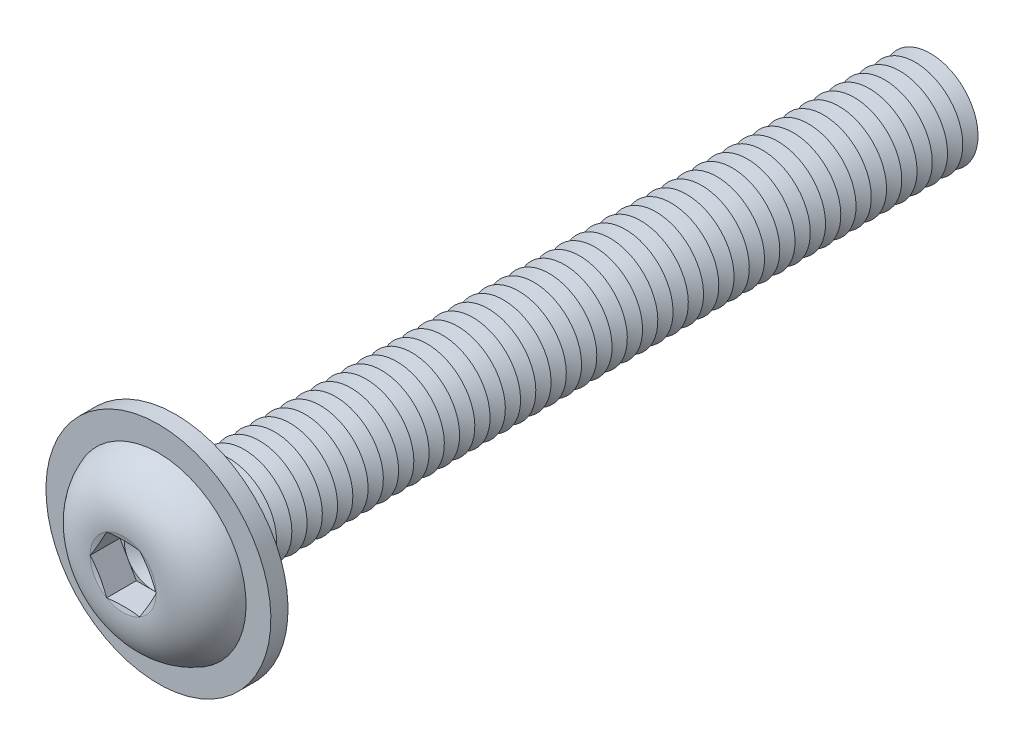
from build123d import *

# Parameters (mm, degrees)
FILLET1_R           = 0.4
LPATTERN1_COUNT     = 50
LPATTERN1_PITCH     = 0.8
CUT_EXTRUDE1_DEPTH  = 1.56
SKETCH5_R           = 5.9
SKETCH5_R_2         = 2.9
BOSS_EXTRUDE1_DEPTH = 0.9


with BuildPart() as part:
    # Sketch1 → Revolve1 (revolve)
    with BuildSketch(Plane(origin=(0, 0, 0), x_dir=(0, 0, -1), z_dir=(1, 0, 0))):
        with BuildLine():
            Line((0, 2.5), (0, 4.75))
            ThreePointArc((0, 4.75), (-2.041477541, 3.848329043), (-2.75, 1.73205))
            Line((-2.75, 1.73205), (-2.517949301, 0.866025))
            Line((-2.517949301, 0.866025), (-2.75, 0.866025))
            Line((-2.75, 0.866025), (-2.75, 0))
            Line((-2.75, 0), (40, 0))
            Line((40, 0), (40, 2.5))
            Line((40, 2.5), (0, 2.5))
        make_face()
    revolve(axis=Axis((0, 0, -40), (0, 0, 1)))

    # Fillet1
    fillet1_edges = [part.edges().sort_by_distance(p)[0] for p in [
        (0, -2.5, 0),
    ]]
    fillet(fillet1_edges, radius=FILLET1_R)

    # Sketch2 → Cut-Revolve1 (revolve, cut)
    with BuildSketch(Plane(origin=(0, 0, 0), x_dir=(0, 0, -1), z_dir=(1, 0, 0))):
        Polygon((39.6, 2.5), (40.4, 2.5), (40, 1.807179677), align=None)
    cut_revolve1 = revolve(axis=Axis((0, 0, -40), (0, 0, -1)), mode=Mode.SUBTRACT)

    # LPattern1: Cut-Revolve1 ×50
    with Locations(*[(0, 0, i * LPATTERN1_PITCH) for i in range(1, LPATTERN1_COUNT)]):
        add(cut_revolve1, mode=Mode.SUBTRACT)

    # Sketch3 → Cut-Extrude1 (cut)
    with BuildSketch(Plane.XY.offset(2.75)):
        Polygon((0.866025, 1.499999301), (-0.866025, 1.499999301), (-1.73205, 0), (-0.866025, -1.499999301), (0.866025, -1.499999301), (1.73205, 0), align=None)
    extrude(amount=-CUT_EXTRUDE1_DEPTH, mode=Mode.SUBTRACT)

    # Cut-Extrude2 cone 1 section (on through the dimple's axis) → Cut-Extrude2 (revolve, cut)
    with BuildSketch(Plane(origin=(0, 0, 1.19), x_dir=(0, -1, 0), z_dir=(1, 0, 0))):
        Polygon((0, 0), (1.499999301, 0), (0, 0.866025), align=None)
    revolve(axis=Axis((0, 0, 1.19), (0, 0, -1)), mode=Mode.SUBTRACT)

    # Sketch5 → Boss-Extrude1 (add)
    with BuildSketch(Plane(origin=(0, 0, 0), x_dir=(-1, 0, 0), z_dir=(0, 0, -1))):
        with Locations(Location((0, 0, 0), (0, 0, 90))):
            Circle(SKETCH5_R)
        Circle(SKETCH5_R_2, mode=Mode.SUBTRACT)
    extrude(amount=-BOSS_EXTRUDE1_DEPTH)


solid = part.part
